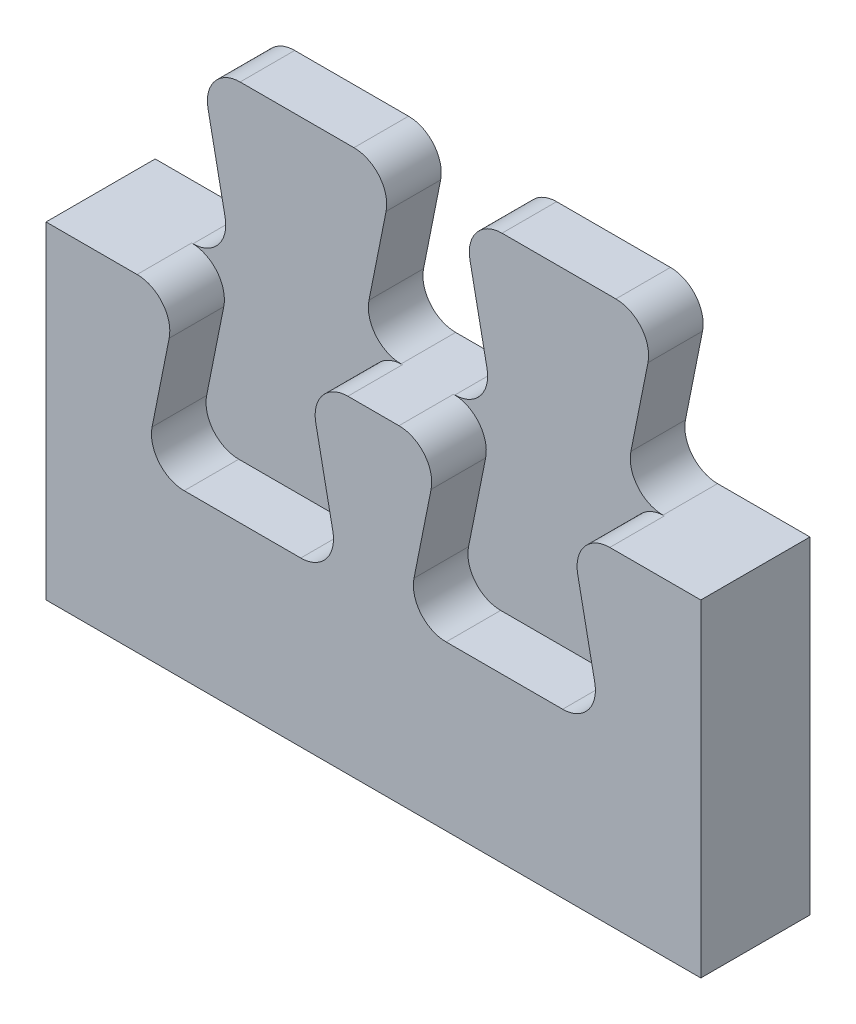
ISO-10303-21;
HEADER;
FILE_DESCRIPTION(('STEP AP214'),'2;1');
FILE_NAME('part.step','',(''),(''),'','','');
FILE_SCHEMA(('AUTOMOTIVE_DESIGN { 1 0 10303 214 1 1 1 1 }'));
ENDSEC;
DATA;
#1=APPLICATION_CONTEXT('core data for automotive mechanical design processes');
#2=APPLICATION_PROTOCOL_DEFINITION('international standard','automotive_design',2000,#1);
#3=PRODUCT_CONTEXT('',#1,'mechanical');
#4=PRODUCT('Part','Part','',(#3));
#5=PRODUCT_RELATED_PRODUCT_CATEGORY('part','',(#4));
#6=PRODUCT_DEFINITION_FORMATION('','',#4);
#7=PRODUCT_DEFINITION_CONTEXT('part definition',#1,'design');
#8=PRODUCT_DEFINITION('design','',#6,#7);
#9=PRODUCT_DEFINITION_SHAPE('','',#8);
#10=(LENGTH_UNIT() NAMED_UNIT(*) SI_UNIT(.MILLI.,.METRE.));
#11=(NAMED_UNIT(*) PLANE_ANGLE_UNIT() SI_UNIT($,.RADIAN.));
#12=(NAMED_UNIT(*) SI_UNIT($,.STERADIAN.) SOLID_ANGLE_UNIT());
#13=UNCERTAINTY_MEASURE_WITH_UNIT(LENGTH_MEASURE(1.E-05),#10,'distance_accuracy_value','');
#14=(GEOMETRIC_REPRESENTATION_CONTEXT(3) GLOBAL_UNCERTAINTY_ASSIGNED_CONTEXT((#13)) GLOBAL_UNIT_ASSIGNED_CONTEXT((#10,
#11,#12)) REPRESENTATION_CONTEXT('',''));
#15=CARTESIAN_POINT('',(0.,0.,0.));
#16=DIRECTION('',(0.,0.,1.));
#17=DIRECTION('',(1.,0.,0.));
#18=AXIS2_PLACEMENT_3D('',#15,#16,#17);
#19=CARTESIAN_POINT('',(-11.7339215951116,36.6112155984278,10.));
#20=DIRECTION('',(-0.98058067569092,-0.196116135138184,0.));
#21=DIRECTION('',(0.196116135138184,-0.98058067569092,0.));
#22=AXIS2_PLACEMENT_3D('',#19,#20,#21);
#23=PLANE('',#22);
#24=DIRECTION('',(-0.196116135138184,0.98058067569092,0.));
#25=VECTOR('',#24,1.);
#26=CARTESIAN_POINT('',(-11.7339215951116,36.6112155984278,0.));
#27=LINE('',#26,#25);
#28=CARTESIAN_POINT('',(-12.4515912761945,40.1995640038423,0.));
#29=VERTEX_POINT('',#28);
#30=CARTESIAN_POINT('',(-14.0162519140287,48.0228671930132,0.));
#31=VERTEX_POINT('',#30);
#32=EDGE_CURVE('E643',#29,#31,#27,.T.);
#33=ORIENTED_EDGE('',*,*,#32,.F.);
#34=DIRECTION('',(0.,0.,-1.));
#35=VECTOR('',#34,1.);
#36=CARTESIAN_POINT('',(-12.4515912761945,40.1995640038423,5.));
#37=LINE('',#36,#35);
#38=CARTESIAN_POINT('',(-12.4515912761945,40.1995640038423,5.));
#39=VERTEX_POINT('',#38);
#40=EDGE_CURVE('E63',#29,#39,#37,.F.);
#41=ORIENTED_EDGE('',*,*,#40,.T.);
#42=DIRECTION('',(0.196116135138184,-0.98058067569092,0.));
#43=VECTOR('',#42,1.);
#44=CARTESIAN_POINT('',(-11.7339215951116,36.6112155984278,5.));
#45=LINE('',#44,#43);
#46=CARTESIAN_POINT('',(-14.0162519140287,48.0228671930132,5.));
#47=VERTEX_POINT('',#46);
#48=EDGE_CURVE('E668',#47,#39,#45,.T.);
#49=ORIENTED_EDGE('',*,*,#48,.F.);
#50=DIRECTION('',(0.,0.,-1.));
#51=VECTOR('',#50,1.);
#52=CARTESIAN_POINT('',(-14.0162519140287,48.0228671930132,10.));
#53=LINE('',#52,#51);
#54=EDGE_CURVE('E457',#47,#31,#53,.T.);
#55=ORIENTED_EDGE('',*,*,#54,.T.);
#56=EDGE_LOOP('',(#33,#41,#49,#55));
#57=FACE_BOUND('',#56,.T.);
#58=ADVANCED_FACE('F41',(#57),#23,.T.);
#59=CARTESIAN_POINT('',(-23.8589215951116,36.6112155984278,10.));
#60=DIRECTION('',(0.,1.,0.));
#61=DIRECTION('',(0.,0.,1.));
#62=AXIS2_PLACEMENT_3D('',#59,#60,#61);
#63=PLANE('',#62);
#64=DIRECTION('',(-1.,0.,0.));
#65=VECTOR('',#64,1.);
#66=CARTESIAN_POINT('',(-23.8589215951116,36.6112155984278,5.));
#67=LINE('',#66,#65);
#68=CARTESIAN_POINT('',(-15.3933333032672,36.6112155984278,5.));
#69=VERTEX_POINT('',#68);
#70=CARTESIAN_POINT('',(-15.5183333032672,36.6112155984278,5.));
#71=VERTEX_POINT('',#70);
#72=EDGE_CURVE('E670',#69,#71,#67,.T.);
#73=ORIENTED_EDGE('',*,*,#72,.F.);
#74=DIRECTION('',(0.,0.,-1.));
#75=VECTOR('',#74,1.);
#76=CARTESIAN_POINT('',(-15.3933333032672,36.6112155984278,0.));
#77=LINE('',#76,#75);
#78=CARTESIAN_POINT('',(-15.3933333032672,36.6112155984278,0.));
#79=VERTEX_POINT('',#78);
#80=EDGE_CURVE('E531',#69,#79,#77,.T.);
#81=ORIENTED_EDGE('',*,*,#80,.T.);
#82=DIRECTION('',(1.,0.,0.));
#83=VECTOR('',#82,1.);
#84=CARTESIAN_POINT('',(-23.8589215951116,36.6112155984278,0.));
#85=LINE('',#84,#83);
#86=CARTESIAN_POINT('',(-23.8589215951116,36.6112155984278,0.));
#87=VERTEX_POINT('',#86);
#88=EDGE_CURVE('E609',#87,#79,#85,.T.);
#89=ORIENTED_EDGE('',*,*,#88,.F.);
#90=DIRECTION('',(0.,0.,-1.));
#91=VECTOR('',#90,1.);
#92=CARTESIAN_POINT('',(-23.8589215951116,36.6112155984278,10.));
#93=LINE('',#92,#91);
#94=CARTESIAN_POINT('',(-23.8589215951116,36.6112155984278,10.));
#95=VERTEX_POINT('',#94);
#96=EDGE_CURVE('E368',#95,#87,#93,.T.);
#97=ORIENTED_EDGE('',*,*,#96,.F.);
#98=DIRECTION('',(1.,0.,0.));
#99=VECTOR('',#98,1.);
#100=CARTESIAN_POINT('',(-23.8589215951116,36.6112155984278,10.));
#101=LINE('',#100,#99);
#102=CARTESIAN_POINT('',(-15.5183333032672,36.6112155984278,10.));
#103=VERTEX_POINT('',#102);
#104=EDGE_CURVE('E352',#95,#103,#101,.T.);
#105=ORIENTED_EDGE('',*,*,#104,.T.);
#106=DIRECTION('',(0.,0.,1.));
#107=VECTOR('',#106,1.);
#108=CARTESIAN_POINT('',(-15.5183333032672,36.6112155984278,5.));
#109=LINE('',#108,#107);
#110=EDGE_CURVE('E481',#103,#71,#109,.F.);
#111=ORIENTED_EDGE('',*,*,#110,.T.);
#112=EDGE_LOOP('',(#73,#81,#89,#97,#105,#111));
#113=FACE_BOUND('',#112,.T.);
#114=ADVANCED_FACE('F773',(#113),#63,.T.);
#115=CARTESIAN_POINT('',(-23.8589215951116,36.6112155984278,10.));
#116=DIRECTION('',(1.,0.,0.));
#117=DIRECTION('',(0.,1.,0.));
#118=AXIS2_PLACEMENT_3D('',#115,#116,#117);
#119=PLANE('',#118);
#120=DIRECTION('',(0.,-1.,0.));
#121=VECTOR('',#120,1.);
#122=CARTESIAN_POINT('',(-23.8589215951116,36.6112155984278,0.));
#123=LINE('',#122,#121);
#124=CARTESIAN_POINT('',(-23.8589215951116,6.61121559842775,0.));
#125=VERTEX_POINT('',#124);
#126=EDGE_CURVE('E606',#87,#125,#123,.T.);
#127=ORIENTED_EDGE('',*,*,#126,.T.);
#128=DIRECTION('',(0.,0.,-1.));
#129=VECTOR('',#128,1.);
#130=CARTESIAN_POINT('',(-23.8589215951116,6.61121559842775,10.));
#131=LINE('',#130,#129);
#132=CARTESIAN_POINT('',(-23.8589215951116,6.61121559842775,10.));
#133=VERTEX_POINT('',#132);
#134=EDGE_CURVE('E357',#133,#125,#131,.T.);
#135=ORIENTED_EDGE('',*,*,#134,.F.);
#136=DIRECTION('',(0.,-1.,0.));
#137=VECTOR('',#136,1.);
#138=CARTESIAN_POINT('',(-23.8589215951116,36.6112155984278,10.));
#139=LINE('',#138,#137);
#140=EDGE_CURVE('E360',#95,#133,#139,.T.);
#141=ORIENTED_EDGE('',*,*,#140,.F.);
#142=ORIENTED_EDGE('',*,*,#96,.T.);
#143=EDGE_LOOP('',(#127,#135,#141,#142));
#144=FACE_BOUND('',#143,.T.);
#145=ADVANCED_FACE('F778',(#144),#119,.F.);
#146=CARTESIAN_POINT('',(-23.8589215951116,6.61121559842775,10.));
#147=DIRECTION('',(0.,1.,0.));
#148=DIRECTION('',(0.,0.,1.));
#149=AXIS2_PLACEMENT_3D('',#146,#147,#148);
#150=PLANE('',#149);
#151=DIRECTION('',(1.,0.,0.));
#152=VECTOR('',#151,1.);
#153=CARTESIAN_POINT('',(-23.8589215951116,6.61121559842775,0.));
#154=LINE('',#153,#152);
#155=CARTESIAN_POINT('',(36.1410784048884,6.61121559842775,0.));
#156=VERTEX_POINT('',#155);
#157=EDGE_CURVE('E603',#125,#156,#154,.T.);
#158=ORIENTED_EDGE('',*,*,#157,.T.);
#159=DIRECTION('',(0.,0.,-1.));
#160=VECTOR('',#159,1.);
#161=CARTESIAN_POINT('',(36.1410784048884,6.61121559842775,10.));
#162=LINE('',#161,#160);
#163=CARTESIAN_POINT('',(36.1410784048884,6.61121559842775,10.));
#164=VERTEX_POINT('',#163);
#165=EDGE_CURVE('E351',#164,#156,#162,.T.);
#166=ORIENTED_EDGE('',*,*,#165,.F.);
#167=DIRECTION('',(1.,0.,0.));
#168=VECTOR('',#167,1.);
#169=CARTESIAN_POINT('',(-23.8589215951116,6.61121559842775,10.));
#170=LINE('',#169,#168);
#171=EDGE_CURVE('E341',#133,#164,#170,.T.);
#172=ORIENTED_EDGE('',*,*,#171,.F.);
#173=ORIENTED_EDGE('',*,*,#134,.T.);
#174=EDGE_LOOP('',(#158,#166,#172,#173));
#175=FACE_BOUND('',#174,.T.);
#176=ADVANCED_FACE('F616',(#175),#150,.F.);
#177=CARTESIAN_POINT('',(36.1410784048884,6.61121559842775,10.));
#178=DIRECTION('',(-1.,0.,0.));
#179=DIRECTION('',(0.,0.,1.));
#180=AXIS2_PLACEMENT_3D('',#177,#178,#179);
#181=PLANE('',#180);
#182=DIRECTION('',(0.,1.,0.));
#183=VECTOR('',#182,1.);
#184=CARTESIAN_POINT('',(36.1410784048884,6.61121559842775,0.));
#185=LINE('',#184,#183);
#186=CARTESIAN_POINT('',(36.1410784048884,36.6112155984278,0.));
#187=VERTEX_POINT('',#186);
#188=EDGE_CURVE('E349',#156,#187,#185,.T.);
#189=ORIENTED_EDGE('',*,*,#188,.T.);
#190=DIRECTION('',(0.,0.,-1.));
#191=VECTOR('',#190,1.);
#192=CARTESIAN_POINT('',(36.1410784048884,36.6112155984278,10.));
#193=LINE('',#192,#191);
#194=CARTESIAN_POINT('',(36.1410784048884,36.6112155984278,10.));
#195=VERTEX_POINT('',#194);
#196=EDGE_CURVE('E328',#195,#187,#193,.T.);
#197=ORIENTED_EDGE('',*,*,#196,.F.);
#198=DIRECTION('',(0.,1.,0.));
#199=VECTOR('',#198,1.);
#200=CARTESIAN_POINT('',(36.1410784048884,6.61121559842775,10.));
#201=LINE('',#200,#199);
#202=EDGE_CURVE('E334',#164,#195,#201,.T.);
#203=ORIENTED_EDGE('',*,*,#202,.F.);
#204=ORIENTED_EDGE('',*,*,#165,.T.);
#205=EDGE_LOOP('',(#189,#197,#203,#204));
#206=FACE_BOUND('',#205,.T.);
#207=ADVANCED_FACE('F347',(#206),#181,.F.);
#208=CARTESIAN_POINT('',(24.0160784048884,36.6112155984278,10.));
#209=DIRECTION('',(0.,1.,0.));
#210=DIRECTION('',(-1.,0.,0.));
#211=AXIS2_PLACEMENT_3D('',#208,#209,#210);
#212=PLANE('',#211);
#213=DIRECTION('',(1.,0.,0.));
#214=VECTOR('',#213,1.);
#215=CARTESIAN_POINT('',(24.0160784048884,36.6112155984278,0.));
#216=LINE('',#215,#214);
#217=CARTESIAN_POINT('',(27.6754901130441,36.6112155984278,0.));
#218=VERTEX_POINT('',#217);
#219=EDGE_CURVE('E599',#218,#187,#216,.T.);
#220=ORIENTED_EDGE('',*,*,#219,.F.);
#221=DIRECTION('',(0.,0.,-1.));
#222=VECTOR('',#221,1.);
#223=CARTESIAN_POINT('',(27.6754901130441,36.6112155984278,5.));
#224=LINE('',#223,#222);
#225=CARTESIAN_POINT('',(27.6754901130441,36.6112155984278,5.));
#226=VERTEX_POINT('',#225);
#227=EDGE_CURVE('E514',#218,#226,#224,.F.);
#228=ORIENTED_EDGE('',*,*,#227,.T.);
#229=DIRECTION('',(-1.,0.,0.));
#230=VECTOR('',#229,1.);
#231=CARTESIAN_POINT('',(24.0160784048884,36.6112155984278,5.));
#232=LINE('',#231,#230);
#233=CARTESIAN_POINT('',(27.8004901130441,36.6112155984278,5.));
#234=VERTEX_POINT('',#233);
#235=EDGE_CURVE('E632',#234,#226,#232,.T.);
#236=ORIENTED_EDGE('',*,*,#235,.F.);
#237=DIRECTION('',(0.,0.,1.));
#238=VECTOR('',#237,1.);
#239=CARTESIAN_POINT('',(27.8004901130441,36.6112155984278,10.));
#240=LINE('',#239,#238);
#241=CARTESIAN_POINT('',(27.8004901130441,36.6112155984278,10.));
#242=VERTEX_POINT('',#241);
#243=EDGE_CURVE('E331',#234,#242,#240,.T.);
#244=ORIENTED_EDGE('',*,*,#243,.T.);
#245=DIRECTION('',(1.,0.,0.));
#246=VECTOR('',#245,1.);
#247=CARTESIAN_POINT('',(24.0160784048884,36.6112155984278,10.));
#248=LINE('',#247,#246);
#249=EDGE_CURVE('E323',#242,#195,#248,.T.);
#250=ORIENTED_EDGE('',*,*,#249,.T.);
#251=ORIENTED_EDGE('',*,*,#196,.T.);
#252=EDGE_LOOP('',(#220,#228,#236,#244,#250,#251));
#253=FACE_BOUND('',#252,.T.);
#254=ADVANCED_FACE('F326',(#253),#212,.T.);
#255=CARTESIAN_POINT('',(27.0160784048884,51.6112155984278,10.));
#256=DIRECTION('',(0.98058067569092,-0.196116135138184,0.));
#257=DIRECTION('',(0.196116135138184,0.98058067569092,0.));
#258=AXIS2_PLACEMENT_3D('',#255,#256,#257);
#259=PLANE('',#258);
#260=DIRECTION('',(0.196116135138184,0.98058067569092,0.));
#261=VECTOR('',#260,1.);
#262=CARTESIAN_POINT('',(27.0160784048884,51.6112155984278,5.));
#263=LINE('',#262,#261);
#264=CARTESIAN_POINT('',(24.7337480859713,40.1995640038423,5.));
#265=VERTEX_POINT('',#264);
#266=CARTESIAN_POINT('',(26.2984087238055,48.0228671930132,5.));
#267=VERTEX_POINT('',#266);
#268=EDGE_CURVE('E631',#265,#267,#263,.T.);
#269=ORIENTED_EDGE('',*,*,#268,.F.);
#270=DIRECTION('',(0.,0.,-1.));
#271=VECTOR('',#270,1.);
#272=CARTESIAN_POINT('',(24.7337480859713,40.1995640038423,0.));
#273=LINE('',#272,#271);
#274=CARTESIAN_POINT('',(24.7337480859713,40.1995640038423,0.));
#275=VERTEX_POINT('',#274);
#276=EDGE_CURVE('E510',#265,#275,#273,.T.);
#277=ORIENTED_EDGE('',*,*,#276,.T.);
#278=DIRECTION('',(-0.196116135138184,-0.98058067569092,0.));
#279=VECTOR('',#278,1.);
#280=CARTESIAN_POINT('',(27.0160784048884,51.6112155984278,0.));
#281=LINE('',#280,#279);
#282=CARTESIAN_POINT('',(26.2984087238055,48.0228671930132,0.));
#283=VERTEX_POINT('',#282);
#284=EDGE_CURVE('E595',#283,#275,#281,.T.);
#285=ORIENTED_EDGE('',*,*,#284,.F.);
#286=DIRECTION('',(0.,0.,-1.));
#287=VECTOR('',#286,1.);
#288=CARTESIAN_POINT('',(26.2984087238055,48.0228671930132,10.));
#289=LINE('',#288,#287);
#290=EDGE_CURVE('E434',#283,#267,#289,.F.);
#291=ORIENTED_EDGE('',*,*,#290,.T.);
#292=EDGE_LOOP('',(#269,#277,#285,#291));
#293=FACE_BOUND('',#292,.T.);
#294=ADVANCED_FACE('F634',(#293),#259,.T.);
#295=CARTESIAN_POINT('',(9.26607840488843,51.6112155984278,10.));
#296=DIRECTION('',(0.,1.,0.));
#297=DIRECTION('',(0.,0.,1.));
#298=AXIS2_PLACEMENT_3D('',#295,#296,#297);
#299=PLANE('',#298);
#300=DIRECTION('',(-1.,0.,0.));
#301=VECTOR('',#300,1.);
#302=CARTESIAN_POINT('',(9.26607840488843,51.6112155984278,5.));
#303=LINE('',#302,#301);
#304=CARTESIAN_POINT('',(23.3566666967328,51.6112155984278,5.));
#305=VERTEX_POINT('',#304);
#306=CARTESIAN_POINT('',(12.9254901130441,51.6112155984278,5.));
#307=VERTEX_POINT('',#306);
#308=EDGE_CURVE('E639',#305,#307,#303,.T.);
#309=ORIENTED_EDGE('',*,*,#308,.F.);
#310=DIRECTION('',(0.,0.,-1.));
#311=VECTOR('',#310,1.);
#312=CARTESIAN_POINT('',(23.3566666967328,51.6112155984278,10.));
#313=LINE('',#312,#311);
#314=CARTESIAN_POINT('',(23.3566666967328,51.6112155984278,0.));
#315=VERTEX_POINT('',#314);
#316=EDGE_CURVE('E423',#305,#315,#313,.T.);
#317=ORIENTED_EDGE('',*,*,#316,.T.);
#318=DIRECTION('',(1.,0.,0.));
#319=VECTOR('',#318,1.);
#320=CARTESIAN_POINT('',(9.26607840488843,51.6112155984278,0.));
#321=LINE('',#320,#319);
#322=CARTESIAN_POINT('',(12.9254901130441,51.6112155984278,0.));
#323=VERTEX_POINT('',#322);
#324=EDGE_CURVE('E587',#323,#315,#321,.T.);
#325=ORIENTED_EDGE('',*,*,#324,.F.);
#326=DIRECTION('',(0.,0.,-1.));
#327=VECTOR('',#326,1.);
#328=CARTESIAN_POINT('',(12.9254901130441,51.6112155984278,10.));
#329=LINE('',#328,#327);
#330=EDGE_CURVE('E421',#323,#307,#329,.F.);
#331=ORIENTED_EDGE('',*,*,#330,.T.);
#332=EDGE_LOOP('',(#309,#317,#325,#331));
#333=FACE_BOUND('',#332,.T.);
#334=ADVANCED_FACE('F839',(#333),#299,.T.);
#335=CARTESIAN_POINT('',(12.2660784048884,36.6112155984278,10.));
#336=DIRECTION('',(-0.98058067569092,-0.196116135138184,0.));
#337=DIRECTION('',(0.196116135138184,-0.98058067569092,0.));
#338=AXIS2_PLACEMENT_3D('',#335,#336,#337);
#339=PLANE('',#338);
#340=DIRECTION('',(-0.196116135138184,0.98058067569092,0.));
#341=VECTOR('',#340,1.);
#342=CARTESIAN_POINT('',(12.2660784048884,36.6112155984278,0.));
#343=LINE('',#342,#341);
#344=CARTESIAN_POINT('',(11.5484087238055,40.1995640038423,0.));
#345=VERTEX_POINT('',#344);
#346=CARTESIAN_POINT('',(9.98374808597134,48.0228671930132,0.));
#347=VERTEX_POINT('',#346);
#348=EDGE_CURVE('E583',#345,#347,#343,.T.);
#349=ORIENTED_EDGE('',*,*,#348,.F.);
#350=DIRECTION('',(0.,0.,-1.));
#351=VECTOR('',#350,1.);
#352=CARTESIAN_POINT('',(11.5484087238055,40.1995640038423,5.));
#353=LINE('',#352,#351);
#354=CARTESIAN_POINT('',(11.5484087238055,40.1995640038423,5.));
#355=VERTEX_POINT('',#354);
#356=EDGE_CURVE('E524',#345,#355,#353,.F.);
#357=ORIENTED_EDGE('',*,*,#356,.T.);
#358=DIRECTION('',(0.196116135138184,-0.98058067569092,0.));
#359=VECTOR('',#358,1.);
#360=CARTESIAN_POINT('',(12.2660784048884,36.6112155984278,5.));
#361=LINE('',#360,#359);
#362=CARTESIAN_POINT('',(9.98374808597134,48.0228671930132,5.));
#363=VERTEX_POINT('',#362);
#364=EDGE_CURVE('E646',#363,#355,#361,.T.);
#365=ORIENTED_EDGE('',*,*,#364,.F.);
#366=DIRECTION('',(0.,0.,-1.));
#367=VECTOR('',#366,1.);
#368=CARTESIAN_POINT('',(9.98374808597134,48.0228671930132,10.));
#369=LINE('',#368,#367);
#370=EDGE_CURVE('E437',#363,#347,#369,.T.);
#371=ORIENTED_EDGE('',*,*,#370,.T.);
#372=EDGE_LOOP('',(#349,#357,#365,#371));
#373=FACE_BOUND('',#372,.T.);
#374=ADVANCED_FACE('F842',(#373),#339,.T.);
#375=CARTESIAN_POINT('',(0.0160784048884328,36.6112155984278,10.));
#376=DIRECTION('',(0.,1.,0.));
#377=DIRECTION('',(0.,0.,1.));
#378=AXIS2_PLACEMENT_3D('',#375,#376,#377);
#379=PLANE('',#378);
#380=DIRECTION('',(-1.,0.,0.));
#381=VECTOR('',#380,1.);
#382=CARTESIAN_POINT('',(0.0160784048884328,36.6112155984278,5.));
#383=LINE('',#382,#381);
#384=CARTESIAN_POINT('',(8.60666669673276,36.6112155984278,5.));
#385=VERTEX_POINT('',#384);
#386=CARTESIAN_POINT('',(8.48166669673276,36.6112155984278,5.));
#387=VERTEX_POINT('',#386);
#388=EDGE_CURVE('E672',#385,#387,#383,.T.);
#389=ORIENTED_EDGE('',*,*,#388,.F.);
#390=DIRECTION('',(0.,0.,-1.));
#391=VECTOR('',#390,1.);
#392=CARTESIAN_POINT('',(8.60666669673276,36.6112155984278,0.));
#393=LINE('',#392,#391);
#394=CARTESIAN_POINT('',(8.60666669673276,36.6112155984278,0.));
#395=VERTEX_POINT('',#394);
#396=EDGE_CURVE('E520',#385,#395,#393,.T.);
#397=ORIENTED_EDGE('',*,*,#396,.T.);
#398=DIRECTION('',(1.,0.,0.));
#399=VECTOR('',#398,1.);
#400=CARTESIAN_POINT('',(0.0160784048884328,36.6112155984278,0.));
#401=LINE('',#400,#399);
#402=CARTESIAN_POINT('',(3.6754901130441,36.6112155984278,0.));
#403=VERTEX_POINT('',#402);
#404=EDGE_CURVE('E576',#403,#395,#401,.T.);
#405=ORIENTED_EDGE('',*,*,#404,.F.);
#406=DIRECTION('',(0.,0.,-1.));
#407=VECTOR('',#406,1.);
#408=CARTESIAN_POINT('',(3.6754901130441,36.6112155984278,5.));
#409=LINE('',#408,#407);
#410=CARTESIAN_POINT('',(3.6754901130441,36.6112155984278,5.));
#411=VERTEX_POINT('',#410);
#412=EDGE_CURVE('E517',#403,#411,#409,.F.);
#413=ORIENTED_EDGE('',*,*,#412,.T.);
#414=CARTESIAN_POINT('',(3.8004901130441,36.6112155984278,5.));
#415=VERTEX_POINT('',#414);
#416=EDGE_CURVE('E558',#415,#411,#383,.T.);
#417=ORIENTED_EDGE('',*,*,#416,.F.);
#418=DIRECTION('',(0.,0.,1.));
#419=VECTOR('',#418,1.);
#420=CARTESIAN_POINT('',(3.8004901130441,36.6112155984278,10.));
#421=LINE('',#420,#419);
#422=CARTESIAN_POINT('',(3.8004901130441,36.6112155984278,10.));
#423=VERTEX_POINT('',#422);
#424=EDGE_CURVE('E411',#415,#423,#421,.T.);
#425=ORIENTED_EDGE('',*,*,#424,.T.);
#426=DIRECTION('',(1.,0.,0.));
#427=VECTOR('',#426,1.);
#428=CARTESIAN_POINT('',(0.0160784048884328,36.6112155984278,10.));
#429=LINE('',#428,#427);
#430=CARTESIAN_POINT('',(8.48166669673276,36.6112155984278,10.));
#431=VERTEX_POINT('',#430);
#432=EDGE_CURVE('E335',#423,#431,#429,.T.);
#433=ORIENTED_EDGE('',*,*,#432,.T.);
#434=DIRECTION('',(0.,0.,1.));
#435=VECTOR('',#434,1.);
#436=CARTESIAN_POINT('',(8.48166669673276,36.6112155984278,5.));
#437=LINE('',#436,#435);
#438=EDGE_CURVE('E415',#431,#387,#437,.F.);
#439=ORIENTED_EDGE('',*,*,#438,.T.);
#440=EDGE_LOOP('',(#389,#397,#405,#413,#417,#425,#433,#439));
#441=FACE_BOUND('',#440,.T.);
#442=ADVANCED_FACE('F580',(#441),#379,.T.);
#443=CARTESIAN_POINT('',(3.01607840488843,51.6112155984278,10.));
#444=DIRECTION('',(0.98058067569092,-0.196116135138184,0.));
#445=DIRECTION('',(0.196116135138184,0.98058067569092,0.));
#446=AXIS2_PLACEMENT_3D('',#443,#444,#445);
#447=PLANE('',#446);
#448=DIRECTION('',(0.196116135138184,0.98058067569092,0.));
#449=VECTOR('',#448,1.);
#450=CARTESIAN_POINT('',(3.01607840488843,51.6112155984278,5.));
#451=LINE('',#450,#449);
#452=CARTESIAN_POINT('',(0.733748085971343,40.1995640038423,5.));
#453=VERTEX_POINT('',#452);
#454=CARTESIAN_POINT('',(2.29840872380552,48.0228671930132,5.));
#455=VERTEX_POINT('',#454);
#456=EDGE_CURVE('E557',#453,#455,#451,.T.);
#457=ORIENTED_EDGE('',*,*,#456,.F.);
#458=DIRECTION('',(0.,0.,-1.));
#459=VECTOR('',#458,1.);
#460=CARTESIAN_POINT('',(0.733748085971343,40.1995640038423,0.));
#461=LINE('',#460,#459);
#462=CARTESIAN_POINT('',(0.733748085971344,40.1995640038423,0.));
#463=VERTEX_POINT('',#462);
#464=EDGE_CURVE('E527',#453,#463,#461,.T.);
#465=ORIENTED_EDGE('',*,*,#464,.T.);
#466=DIRECTION('',(-0.196116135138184,-0.98058067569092,0.));
#467=VECTOR('',#466,1.);
#468=CARTESIAN_POINT('',(3.01607840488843,51.6112155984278,0.));
#469=LINE('',#468,#467);
#470=CARTESIAN_POINT('',(2.29840872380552,48.0228671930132,0.));
#471=VERTEX_POINT('',#470);
#472=EDGE_CURVE('E577',#471,#463,#469,.T.);
#473=ORIENTED_EDGE('',*,*,#472,.F.);
#474=DIRECTION('',(0.,0.,-1.));
#475=VECTOR('',#474,1.);
#476=CARTESIAN_POINT('',(2.29840872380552,48.0228671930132,10.));
#477=LINE('',#476,#475);
#478=EDGE_CURVE('E445',#471,#455,#477,.F.);
#479=ORIENTED_EDGE('',*,*,#478,.T.);
#480=EDGE_LOOP('',(#457,#465,#473,#479));
#481=FACE_BOUND('',#480,.T.);
#482=ADVANCED_FACE('F563',(#481),#447,.T.);
#483=CARTESIAN_POINT('',(-14.7339215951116,51.6112155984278,10.));
#484=DIRECTION('',(0.,1.,0.));
#485=DIRECTION('',(-1.,0.,0.));
#486=AXIS2_PLACEMENT_3D('',#483,#484,#485);
#487=PLANE('',#486);
#488=DIRECTION('',(-1.,0.,0.));
#489=VECTOR('',#488,1.);
#490=CARTESIAN_POINT('',(-14.7339215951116,51.6112155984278,5.));
#491=LINE('',#490,#489);
#492=CARTESIAN_POINT('',(-0.643333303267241,51.6112155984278,5.));
#493=VERTEX_POINT('',#492);
#494=CARTESIAN_POINT('',(-11.0745098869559,51.6112155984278,5.));
#495=VERTEX_POINT('',#494);
#496=EDGE_CURVE('E364',#493,#495,#491,.T.);
#497=ORIENTED_EDGE('',*,*,#496,.F.);
#498=DIRECTION('',(0.,0.,-1.));
#499=VECTOR('',#498,1.);
#500=CARTESIAN_POINT('',(-0.643333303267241,51.6112155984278,10.));
#501=LINE('',#500,#499);
#502=CARTESIAN_POINT('',(-0.643333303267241,51.6112155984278,0.));
#503=VERTEX_POINT('',#502);
#504=EDGE_CURVE('E442',#493,#503,#501,.T.);
#505=ORIENTED_EDGE('',*,*,#504,.T.);
#506=DIRECTION('',(1.,0.,0.));
#507=VECTOR('',#506,1.);
#508=CARTESIAN_POINT('',(-14.7339215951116,51.6112155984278,0.));
#509=LINE('',#508,#507);
#510=CARTESIAN_POINT('',(-11.0745098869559,51.6112155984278,0.));
#511=VERTEX_POINT('',#510);
#512=EDGE_CURVE('E590',#511,#503,#509,.T.);
#513=ORIENTED_EDGE('',*,*,#512,.F.);
#514=DIRECTION('',(0.,0.,-1.));
#515=VECTOR('',#514,1.);
#516=CARTESIAN_POINT('',(-11.0745098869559,51.6112155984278,10.));
#517=LINE('',#516,#515);
#518=EDGE_CURVE('E440',#511,#495,#517,.F.);
#519=ORIENTED_EDGE('',*,*,#518,.T.);
#520=EDGE_LOOP('',(#497,#505,#513,#519));
#521=FACE_BOUND('',#520,.T.);
#522=ADVANCED_FACE('F662',(#521),#487,.T.);
#523=CARTESIAN_POINT('',(0.,0.,10.));
#524=DIRECTION('',(0.,0.,-1.));
#525=DIRECTION('',(-1.,0.,0.));
#526=AXIS2_PLACEMENT_3D('',#523,#524,#525);
#527=PLANE('',#526);
#528=DIRECTION('',(-0.196116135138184,-0.98058067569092,0.));
#529=VECTOR('',#528,1.);
#530=CARTESIAN_POINT('',(12.1410784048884,36.6112155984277,10.));
#531=LINE('',#530,#529);
#532=CARTESIAN_POINT('',(11.4234087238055,33.0228671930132,10.));
#533=VERTEX_POINT('',#532);
#534=CARTESIAN_POINT('',(9.85874808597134,25.1995640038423,10.));
#535=VERTEX_POINT('',#534);
#536=EDGE_CURVE('E691',#533,#535,#531,.T.);
#537=ORIENTED_EDGE('',*,*,#536,.F.);
#538=CARTESIAN_POINT('',(8.48166669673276,33.6112155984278,10.));
#539=DIRECTION('',(0.,0.,-1.));
#540=DIRECTION('',(-1.,0.,0.));
#541=AXIS2_PLACEMENT_3D('',#538,#539,#540);
#542=CIRCLE('',#541,3.);
#543=EDGE_CURVE('E408',#533,#431,#542,.F.);
#544=ORIENTED_EDGE('',*,*,#543,.T.);
#545=ORIENTED_EDGE('',*,*,#432,.F.);
#546=CARTESIAN_POINT('',(3.8004901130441,33.6112155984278,10.));
#547=DIRECTION('',(0.,0.,-1.));
#548=DIRECTION('',(-1.,0.,0.));
#549=AXIS2_PLACEMENT_3D('',#546,#547,#548);
#550=CIRCLE('',#549,3.);
#551=CARTESIAN_POINT('',(0.858748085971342,33.0228671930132,10.));
#552=VERTEX_POINT('',#551);
#553=EDGE_CURVE('E402',#423,#552,#550,.F.);
#554=ORIENTED_EDGE('',*,*,#553,.T.);
#555=DIRECTION('',(-0.196116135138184,0.98058067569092,0.));
#556=VECTOR('',#555,1.);
#557=CARTESIAN_POINT('',(3.14107840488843,21.6112155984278,10.));
#558=LINE('',#557,#556);
#559=CARTESIAN_POINT('',(2.42340872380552,25.1995640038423,10.));
#560=VERTEX_POINT('',#559);
#561=EDGE_CURVE('E697',#560,#552,#558,.T.);
#562=ORIENTED_EDGE('',*,*,#561,.F.);
#563=CARTESIAN_POINT('',(-0.518333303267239,24.6112155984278,10.));
#564=DIRECTION('',(0.,0.,-1.));
#565=DIRECTION('',(-1.,0.,0.));
#566=AXIS2_PLACEMENT_3D('',#563,#564,#565);
#567=CIRCLE('',#566,3.);
#568=CARTESIAN_POINT('',(-0.518333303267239,21.6112155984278,10.));
#569=VERTEX_POINT('',#568);
#570=EDGE_CURVE('E500',#560,#569,#567,.T.);
#571=ORIENTED_EDGE('',*,*,#570,.T.);
#572=DIRECTION('',(1.,0.,0.));
#573=VECTOR('',#572,1.);
#574=CARTESIAN_POINT('',(-14.8589215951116,21.6112155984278,10.));
#575=LINE('',#574,#573);
#576=CARTESIAN_POINT('',(-11.1995098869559,21.6112155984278,10.));
#577=VERTEX_POINT('',#576);
#578=EDGE_CURVE('E706',#577,#569,#575,.T.);
#579=ORIENTED_EDGE('',*,*,#578,.F.);
#580=CARTESIAN_POINT('',(-11.1995098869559,24.6112155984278,10.));
#581=DIRECTION('',(0.,0.,-1.));
#582=DIRECTION('',(-1.,0.,0.));
#583=AXIS2_PLACEMENT_3D('',#580,#581,#582);
#584=CIRCLE('',#583,3.);
#585=CARTESIAN_POINT('',(-14.1412519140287,25.1995640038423,10.));
#586=VERTEX_POINT('',#585);
#587=EDGE_CURVE('E497',#577,#586,#584,.T.);
#588=ORIENTED_EDGE('',*,*,#587,.T.);
#589=DIRECTION('',(-0.196116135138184,-0.98058067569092,0.));
#590=VECTOR('',#589,1.);
#591=CARTESIAN_POINT('',(-11.8589215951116,36.6112155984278,10.));
#592=LINE('',#591,#590);
#593=CARTESIAN_POINT('',(-12.5765912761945,33.0228671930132,10.));
#594=VERTEX_POINT('',#593);
#595=EDGE_CURVE('E737',#594,#586,#592,.T.);
#596=ORIENTED_EDGE('',*,*,#595,.F.);
#597=CARTESIAN_POINT('',(-15.5183333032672,33.6112155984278,10.));
#598=DIRECTION('',(0.,0.,-1.));
#599=DIRECTION('',(-1.,0.,0.));
#600=AXIS2_PLACEMENT_3D('',#597,#598,#599);
#601=CIRCLE('',#600,3.);
#602=EDGE_CURVE('E399',#594,#103,#601,.F.);
#603=ORIENTED_EDGE('',*,*,#602,.T.);
#604=ORIENTED_EDGE('',*,*,#104,.F.);
#605=ORIENTED_EDGE('',*,*,#140,.T.);
#606=ORIENTED_EDGE('',*,*,#171,.T.);
#607=ORIENTED_EDGE('',*,*,#202,.T.);
#608=ORIENTED_EDGE('',*,*,#249,.F.);
#609=CARTESIAN_POINT('',(27.8004901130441,33.6112155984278,10.));
#610=DIRECTION('',(0.,0.,-1.));
#611=DIRECTION('',(-1.,0.,0.));
#612=AXIS2_PLACEMENT_3D('',#609,#610,#611);
#613=CIRCLE('',#612,3.);
#614=CARTESIAN_POINT('',(24.8587480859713,33.0228671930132,10.));
#615=VERTEX_POINT('',#614);
#616=EDGE_CURVE('E405',#242,#615,#613,.F.);
#617=ORIENTED_EDGE('',*,*,#616,.T.);
#618=DIRECTION('',(-0.196116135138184,0.98058067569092,0.));
#619=VECTOR('',#618,1.);
#620=CARTESIAN_POINT('',(27.1410784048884,21.6112155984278,10.));
#621=LINE('',#620,#619);
#622=CARTESIAN_POINT('',(26.4234087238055,25.1995640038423,10.));
#623=VERTEX_POINT('',#622);
#624=EDGE_CURVE('E702',#623,#615,#621,.T.);
#625=ORIENTED_EDGE('',*,*,#624,.F.);
#626=CARTESIAN_POINT('',(23.4816666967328,24.6112155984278,10.));
#627=DIRECTION('',(0.,0.,-1.));
#628=DIRECTION('',(-1.,0.,0.));
#629=AXIS2_PLACEMENT_3D('',#626,#627,#628);
#630=CIRCLE('',#629,3.);
#631=CARTESIAN_POINT('',(23.4816666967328,21.6112155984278,10.));
#632=VERTEX_POINT('',#631);
#633=EDGE_CURVE('E484',#623,#632,#630,.T.);
#634=ORIENTED_EDGE('',*,*,#633,.T.);
#635=DIRECTION('',(1.,0.,0.));
#636=VECTOR('',#635,1.);
#637=CARTESIAN_POINT('',(9.14107840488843,21.6112155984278,10.));
#638=LINE('',#637,#636);
#639=CARTESIAN_POINT('',(12.8004901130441,21.6112155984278,10.));
#640=VERTEX_POINT('',#639);
#641=EDGE_CURVE('E696',#640,#632,#638,.T.);
#642=ORIENTED_EDGE('',*,*,#641,.F.);
#643=CARTESIAN_POINT('',(12.8004901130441,24.6112155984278,10.));
#644=DIRECTION('',(0.,0.,-1.));
#645=DIRECTION('',(-1.,0.,0.));
#646=AXIS2_PLACEMENT_3D('',#643,#644,#645);
#647=CIRCLE('',#646,3.);
#648=EDGE_CURVE('E487',#640,#535,#647,.T.);
#649=ORIENTED_EDGE('',*,*,#648,.T.);
#650=EDGE_LOOP('',(#537,#544,#545,#554,#562,#571,#579,#588,#596,#603,#604,#605,#606,#607,#608,
#617,#625,#634,#642,#649));
#651=FACE_BOUND('',#650,.T.);
#652=ADVANCED_FACE('F339',(#651),#527,.F.);
#653=CARTESIAN_POINT('',(0.,0.,0.));
#654=DIRECTION('',(0.,0.,-1.));
#655=DIRECTION('',(-1.,0.,0.));
#656=AXIS2_PLACEMENT_3D('',#653,#654,#655);
#657=PLANE('',#656);
#658=ORIENTED_EDGE('',*,*,#324,.T.);
#659=CARTESIAN_POINT('',(23.3566666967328,48.6112155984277,0.));
#660=DIRECTION('',(0.,0.,-1.));
#661=DIRECTION('',(-1.,0.,0.));
#662=AXIS2_PLACEMENT_3D('',#659,#660,#661);
#663=CIRCLE('',#662,3.);
#664=EDGE_CURVE('E432',#315,#283,#663,.T.);
#665=ORIENTED_EDGE('',*,*,#664,.T.);
#666=ORIENTED_EDGE('',*,*,#284,.T.);
#667=CARTESIAN_POINT('',(27.6754901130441,39.6112155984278,0.));
#668=DIRECTION('',(0.,0.,-1.));
#669=DIRECTION('',(-1.,0.,0.));
#670=AXIS2_PLACEMENT_3D('',#667,#668,#669);
#671=CIRCLE('',#670,3.);
#672=EDGE_CURVE('E535',#275,#218,#671,.F.);
#673=ORIENTED_EDGE('',*,*,#672,.T.);
#674=ORIENTED_EDGE('',*,*,#219,.T.);
#675=ORIENTED_EDGE('',*,*,#188,.F.);
#676=ORIENTED_EDGE('',*,*,#157,.F.);
#677=ORIENTED_EDGE('',*,*,#126,.F.);
#678=ORIENTED_EDGE('',*,*,#88,.T.);
#679=CARTESIAN_POINT('',(-15.3933333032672,39.6112155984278,0.));
#680=DIRECTION('',(0.,0.,-1.));
#681=DIRECTION('',(-1.,0.,0.));
#682=AXIS2_PLACEMENT_3D('',#679,#680,#681);
#683=CIRCLE('',#682,3.);
#684=EDGE_CURVE('E50',#79,#29,#683,.F.);
#685=ORIENTED_EDGE('',*,*,#684,.T.);
#686=ORIENTED_EDGE('',*,*,#32,.T.);
#687=CARTESIAN_POINT('',(-11.0745098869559,48.6112155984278,0.));
#688=DIRECTION('',(0.,0.,-1.));
#689=DIRECTION('',(-1.,0.,0.));
#690=AXIS2_PLACEMENT_3D('',#687,#688,#689);
#691=CIRCLE('',#690,3.);
#692=EDGE_CURVE('E426',#31,#511,#691,.T.);
#693=ORIENTED_EDGE('',*,*,#692,.T.);
#694=ORIENTED_EDGE('',*,*,#512,.T.);
#695=CARTESIAN_POINT('',(-0.643333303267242,48.6112155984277,0.));
#696=DIRECTION('',(0.,0.,-1.));
#697=DIRECTION('',(-1.,0.,0.));
#698=AXIS2_PLACEMENT_3D('',#695,#696,#697);
#699=CIRCLE('',#698,3.);
#700=EDGE_CURVE('E428',#503,#471,#699,.T.);
#701=ORIENTED_EDGE('',*,*,#700,.T.);
#702=ORIENTED_EDGE('',*,*,#472,.T.);
#703=CARTESIAN_POINT('',(3.6754901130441,39.6112155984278,0.));
#704=DIRECTION('',(0.,0.,-1.));
#705=DIRECTION('',(-1.,0.,0.));
#706=AXIS2_PLACEMENT_3D('',#703,#704,#705);
#707=CIRCLE('',#706,3.);
#708=EDGE_CURVE('E547',#463,#403,#707,.F.);
#709=ORIENTED_EDGE('',*,*,#708,.T.);
#710=ORIENTED_EDGE('',*,*,#404,.T.);
#711=CARTESIAN_POINT('',(8.60666669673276,39.6112155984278,0.));
#712=DIRECTION('',(0.,0.,-1.));
#713=DIRECTION('',(-1.,0.,0.));
#714=AXIS2_PLACEMENT_3D('',#711,#712,#713);
#715=CIRCLE('',#714,3.);
#716=EDGE_CURVE('E541',#395,#345,#715,.F.);
#717=ORIENTED_EDGE('',*,*,#716,.T.);
#718=ORIENTED_EDGE('',*,*,#348,.T.);
#719=CARTESIAN_POINT('',(12.9254901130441,48.6112155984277,0.));
#720=DIRECTION('',(0.,0.,-1.));
#721=DIRECTION('',(-1.,0.,0.));
#722=AXIS2_PLACEMENT_3D('',#719,#720,#721);
#723=CIRCLE('',#722,3.);
#724=EDGE_CURVE('E430',#347,#323,#723,.T.);
#725=ORIENTED_EDGE('',*,*,#724,.T.);
#726=EDGE_LOOP('',(#658,#665,#666,#673,#674,#675,#676,#677,#678,#685,#686,#693,#694,#701,#702,
#709,#710,#717,#718,#725));
#727=FACE_BOUND('',#726,.T.);
#728=ADVANCED_FACE('F575',(#727),#657,.T.);
#729=CARTESIAN_POINT('',(-11.8589215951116,36.6112155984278,5.));
#730=DIRECTION('',(-0.98058067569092,0.196116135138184,0.));
#731=DIRECTION('',(-0.196116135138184,-0.98058067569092,0.));
#732=AXIS2_PLACEMENT_3D('',#729,#730,#731);
#733=PLANE('',#732);
#734=ORIENTED_EDGE('',*,*,#595,.T.);
#735=DIRECTION('',(0.,0.,1.));
#736=VECTOR('',#735,1.);
#737=CARTESIAN_POINT('',(-14.1412519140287,25.1995640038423,5.));
#738=LINE('',#737,#736);
#739=CARTESIAN_POINT('',(-14.1412519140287,25.1995640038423,5.));
#740=VERTEX_POINT('',#739);
#741=EDGE_CURVE('E471',#586,#740,#738,.F.);
#742=ORIENTED_EDGE('',*,*,#741,.T.);
#743=DIRECTION('',(-0.196116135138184,-0.98058067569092,0.));
#744=VECTOR('',#743,1.);
#745=CARTESIAN_POINT('',(-11.8589215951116,36.6112155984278,5.));
#746=LINE('',#745,#744);
#747=CARTESIAN_POINT('',(-12.5765912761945,33.0228671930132,5.));
#748=VERTEX_POINT('',#747);
#749=EDGE_CURVE('E711',#748,#740,#746,.T.);
#750=ORIENTED_EDGE('',*,*,#749,.F.);
#751=DIRECTION('',(0.,0.,1.));
#752=VECTOR('',#751,1.);
#753=CARTESIAN_POINT('',(-12.5765912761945,33.0228671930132,10.));
#754=LINE('',#753,#752);
#755=EDGE_CURVE('E467',#748,#594,#754,.T.);
#756=ORIENTED_EDGE('',*,*,#755,.T.);
#757=EDGE_LOOP('',(#734,#742,#750,#756));
#758=FACE_BOUND('',#757,.T.);
#759=ADVANCED_FACE('F819',(#758),#733,.F.);
#760=CARTESIAN_POINT('',(-14.8589215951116,21.6112155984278,5.));
#761=DIRECTION('',(0.,-1.,0.));
#762=DIRECTION('',(1.,0.,0.));
#763=AXIS2_PLACEMENT_3D('',#760,#761,#762);
#764=PLANE('',#763);
#765=DIRECTION('',(1.,0.,0.));
#766=VECTOR('',#765,1.);
#767=CARTESIAN_POINT('',(-14.8589215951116,21.6112155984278,5.));
#768=LINE('',#767,#766);
#769=CARTESIAN_POINT('',(-11.1995098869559,21.6112155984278,5.));
#770=VERTEX_POINT('',#769);
#771=CARTESIAN_POINT('',(-0.518333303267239,21.6112155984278,5.));
#772=VERTEX_POINT('',#771);
#773=EDGE_CURVE('E717',#770,#772,#768,.T.);
#774=ORIENTED_EDGE('',*,*,#773,.F.);
#775=DIRECTION('',(0.,0.,1.));
#776=VECTOR('',#775,1.);
#777=CARTESIAN_POINT('',(-11.1995098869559,21.6112155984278,10.));
#778=LINE('',#777,#776);
#779=EDGE_CURVE('E463',#770,#577,#778,.T.);
#780=ORIENTED_EDGE('',*,*,#779,.T.);
#781=ORIENTED_EDGE('',*,*,#578,.T.);
#782=DIRECTION('',(0.,0.,1.));
#783=VECTOR('',#782,1.);
#784=CARTESIAN_POINT('',(-0.518333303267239,21.6112155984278,5.));
#785=LINE('',#784,#783);
#786=EDGE_CURVE('E460',#569,#772,#785,.F.);
#787=ORIENTED_EDGE('',*,*,#786,.T.);
#788=EDGE_LOOP('',(#774,#780,#781,#787));
#789=FACE_BOUND('',#788,.T.);
#790=ADVANCED_FACE('F746',(#789),#764,.F.);
#791=CARTESIAN_POINT('',(3.14107840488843,21.6112155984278,5.));
#792=DIRECTION('',(0.98058067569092,0.196116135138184,0.));
#793=DIRECTION('',(-0.196116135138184,0.98058067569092,0.));
#794=AXIS2_PLACEMENT_3D('',#791,#792,#793);
#795=PLANE('',#794);
#796=DIRECTION('',(-0.196116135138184,0.98058067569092,0.));
#797=VECTOR('',#796,1.);
#798=CARTESIAN_POINT('',(3.14107840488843,21.6112155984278,5.));
#799=LINE('',#798,#797);
#800=CARTESIAN_POINT('',(2.42340872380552,25.1995640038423,5.));
#801=VERTEX_POINT('',#800);
#802=CARTESIAN_POINT('',(0.858748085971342,33.0228671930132,5.));
#803=VERTEX_POINT('',#802);
#804=EDGE_CURVE('E723',#801,#803,#799,.T.);
#805=ORIENTED_EDGE('',*,*,#804,.F.);
#806=DIRECTION('',(0.,0.,1.));
#807=VECTOR('',#806,1.);
#808=CARTESIAN_POINT('',(2.42340872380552,25.1995640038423,10.));
#809=LINE('',#808,#807);
#810=EDGE_CURVE('E477',#801,#560,#809,.T.);
#811=ORIENTED_EDGE('',*,*,#810,.T.);
#812=ORIENTED_EDGE('',*,*,#561,.T.);
#813=DIRECTION('',(0.,0.,1.));
#814=VECTOR('',#813,1.);
#815=CARTESIAN_POINT('',(0.858748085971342,33.0228671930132,5.));
#816=LINE('',#815,#814);
#817=EDGE_CURVE('E474',#552,#803,#816,.F.);
#818=ORIENTED_EDGE('',*,*,#817,.T.);
#819=EDGE_LOOP('',(#805,#811,#812,#818));
#820=FACE_BOUND('',#819,.T.);
#821=ADVANCED_FACE('F755',(#820),#795,.F.);
#822=CARTESIAN_POINT('',(0.,0.,5.));
#823=DIRECTION('',(0.,0.,-1.));
#824=DIRECTION('',(-1.,0.,0.));
#825=AXIS2_PLACEMENT_3D('',#822,#823,#824);
#826=PLANE('',#825);
#827=ORIENTED_EDGE('',*,*,#416,.T.);
#828=CARTESIAN_POINT('',(3.6754901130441,39.6112155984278,5.));
#829=DIRECTION('',(0.,0.,-1.));
#830=DIRECTION('',(-1.,0.,0.));
#831=AXIS2_PLACEMENT_3D('',#828,#829,#830);
#832=CIRCLE('',#831,3.);
#833=EDGE_CURVE('E550',#411,#453,#832,.T.);
#834=ORIENTED_EDGE('',*,*,#833,.T.);
#835=ORIENTED_EDGE('',*,*,#456,.T.);
#836=CARTESIAN_POINT('',(-0.643333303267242,48.6112155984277,5.));
#837=DIRECTION('',(0.,0.,-1.));
#838=DIRECTION('',(-1.,0.,0.));
#839=AXIS2_PLACEMENT_3D('',#836,#837,#838);
#840=CIRCLE('',#839,3.);
#841=EDGE_CURVE('E455',#455,#493,#840,.F.);
#842=ORIENTED_EDGE('',*,*,#841,.T.);
#843=ORIENTED_EDGE('',*,*,#496,.T.);
#844=CARTESIAN_POINT('',(-11.0745098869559,48.6112155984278,5.));
#845=DIRECTION('',(0.,0.,-1.));
#846=DIRECTION('',(-1.,0.,0.));
#847=AXIS2_PLACEMENT_3D('',#844,#845,#846);
#848=CIRCLE('',#847,3.);
#849=EDGE_CURVE('E453',#495,#47,#848,.F.);
#850=ORIENTED_EDGE('',*,*,#849,.T.);
#851=ORIENTED_EDGE('',*,*,#48,.T.);
#852=CARTESIAN_POINT('',(-15.3933333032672,39.6112155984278,5.));
#853=DIRECTION('',(0.,0.,-1.));
#854=DIRECTION('',(-1.,0.,0.));
#855=AXIS2_PLACEMENT_3D('',#852,#853,#854);
#856=CIRCLE('',#855,3.);
#857=EDGE_CURVE('E11',#39,#69,#856,.T.);
#858=ORIENTED_EDGE('',*,*,#857,.T.);
#859=ORIENTED_EDGE('',*,*,#72,.T.);
#860=CARTESIAN_POINT('',(-15.5183333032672,33.6112155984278,5.));
#861=DIRECTION('',(0.,0.,-1.));
#862=DIRECTION('',(-1.,0.,0.));
#863=AXIS2_PLACEMENT_3D('',#860,#861,#862);
#864=CIRCLE('',#863,3.);
#865=EDGE_CURVE('E507',#71,#748,#864,.T.);
#866=ORIENTED_EDGE('',*,*,#865,.T.);
#867=ORIENTED_EDGE('',*,*,#749,.T.);
#868=CARTESIAN_POINT('',(-11.1995098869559,24.6112155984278,5.));
#869=DIRECTION('',(0.,0.,-1.));
#870=DIRECTION('',(-1.,0.,0.));
#871=AXIS2_PLACEMENT_3D('',#868,#869,#870);
#872=CIRCLE('',#871,3.);
#873=EDGE_CURVE('E451',#740,#770,#872,.F.);
#874=ORIENTED_EDGE('',*,*,#873,.T.);
#875=ORIENTED_EDGE('',*,*,#773,.T.);
#876=CARTESIAN_POINT('',(-0.518333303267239,24.6112155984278,5.));
#877=DIRECTION('',(0.,0.,-1.));
#878=DIRECTION('',(-1.,0.,0.));
#879=AXIS2_PLACEMENT_3D('',#876,#877,#878);
#880=CIRCLE('',#879,3.);
#881=EDGE_CURVE('E448',#772,#801,#880,.F.);
#882=ORIENTED_EDGE('',*,*,#881,.T.);
#883=ORIENTED_EDGE('',*,*,#804,.T.);
#884=CARTESIAN_POINT('',(3.8004901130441,33.6112155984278,5.));
#885=DIRECTION('',(0.,0.,-1.));
#886=DIRECTION('',(-1.,0.,0.));
#887=AXIS2_PLACEMENT_3D('',#884,#885,#886);
#888=CIRCLE('',#887,3.);
#889=EDGE_CURVE('E503',#803,#415,#888,.T.);
#890=ORIENTED_EDGE('',*,*,#889,.T.);
#891=EDGE_LOOP('',(#827,#834,#835,#842,#843,#850,#851,#858,#859,#866,#867,#874,#875,#882,#883,#890));
#892=FACE_BOUND('',#891,.T.);
#893=ADVANCED_FACE('F556',(#892),#826,.F.);
#894=DIRECTION('',(1.,0.,0.));
#895=VECTOR('',#894,1.);
#896=CARTESIAN_POINT('',(9.14107840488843,21.6112155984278,5.));
#897=LINE('',#896,#895);
#898=CARTESIAN_POINT('',(12.8004901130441,21.6112155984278,5.));
#899=VERTEX_POINT('',#898);
#900=CARTESIAN_POINT('',(23.4816666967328,21.6112155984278,5.));
#901=VERTEX_POINT('',#900);
#902=EDGE_CURVE('E731',#899,#901,#897,.T.);
#903=ORIENTED_EDGE('',*,*,#902,.T.);
#904=CARTESIAN_POINT('',(23.4816666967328,24.6112155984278,5.));
#905=DIRECTION('',(0.,0.,-1.));
#906=DIRECTION('',(-1.,0.,0.));
#907=AXIS2_PLACEMENT_3D('',#904,#905,#906);
#908=CIRCLE('',#907,3.);
#909=CARTESIAN_POINT('',(26.4234087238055,25.1995640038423,5.));
#910=VERTEX_POINT('',#909);
#911=EDGE_CURVE('E389',#901,#910,#908,.F.);
#912=ORIENTED_EDGE('',*,*,#911,.T.);
#913=DIRECTION('',(-0.196116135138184,0.98058067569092,0.));
#914=VECTOR('',#913,1.);
#915=CARTESIAN_POINT('',(27.1410784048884,21.6112155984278,5.));
#916=LINE('',#915,#914);
#917=CARTESIAN_POINT('',(24.8587480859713,33.0228671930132,5.));
#918=VERTEX_POINT('',#917);
#919=EDGE_CURVE('E569',#910,#918,#916,.T.);
#920=ORIENTED_EDGE('',*,*,#919,.T.);
#921=CARTESIAN_POINT('',(27.8004901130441,33.6112155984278,5.));
#922=DIRECTION('',(0.,0.,-1.));
#923=DIRECTION('',(-1.,0.,0.));
#924=AXIS2_PLACEMENT_3D('',#921,#922,#923);
#925=CIRCLE('',#924,3.);
#926=EDGE_CURVE('E493',#918,#234,#925,.T.);
#927=ORIENTED_EDGE('',*,*,#926,.T.);
#928=ORIENTED_EDGE('',*,*,#235,.T.);
#929=CARTESIAN_POINT('',(27.6754901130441,39.6112155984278,5.));
#930=DIRECTION('',(0.,0.,-1.));
#931=DIRECTION('',(-1.,0.,0.));
#932=AXIS2_PLACEMENT_3D('',#929,#930,#931);
#933=CIRCLE('',#932,3.);
#934=EDGE_CURVE('E538',#226,#265,#933,.T.);
#935=ORIENTED_EDGE('',*,*,#934,.T.);
#936=ORIENTED_EDGE('',*,*,#268,.T.);
#937=CARTESIAN_POINT('',(23.3566666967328,48.6112155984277,5.));
#938=DIRECTION('',(0.,0.,-1.));
#939=DIRECTION('',(-1.,0.,0.));
#940=AXIS2_PLACEMENT_3D('',#937,#938,#939);
#941=CIRCLE('',#940,3.);
#942=EDGE_CURVE('E384',#267,#305,#941,.F.);
#943=ORIENTED_EDGE('',*,*,#942,.T.);
#944=ORIENTED_EDGE('',*,*,#308,.T.);
#945=CARTESIAN_POINT('',(12.9254901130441,48.6112155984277,5.));
#946=DIRECTION('',(0.,0.,-1.));
#947=DIRECTION('',(-1.,0.,0.));
#948=AXIS2_PLACEMENT_3D('',#945,#946,#947);
#949=CIRCLE('',#948,3.);
#950=EDGE_CURVE('E382',#307,#363,#949,.F.);
#951=ORIENTED_EDGE('',*,*,#950,.T.);
#952=ORIENTED_EDGE('',*,*,#364,.T.);
#953=CARTESIAN_POINT('',(8.60666669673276,39.6112155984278,5.));
#954=DIRECTION('',(0.,0.,-1.));
#955=DIRECTION('',(-1.,0.,0.));
#956=AXIS2_PLACEMENT_3D('',#953,#954,#955);
#957=CIRCLE('',#956,3.);
#958=EDGE_CURVE('E544',#355,#385,#957,.T.);
#959=ORIENTED_EDGE('',*,*,#958,.T.);
#960=ORIENTED_EDGE('',*,*,#388,.T.);
#961=CARTESIAN_POINT('',(8.48166669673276,33.6112155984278,5.));
#962=DIRECTION('',(0.,0.,-1.));
#963=DIRECTION('',(-1.,0.,0.));
#964=AXIS2_PLACEMENT_3D('',#961,#962,#963);
#965=CIRCLE('',#964,3.);
#966=CARTESIAN_POINT('',(11.4234087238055,33.0228671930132,5.));
#967=VERTEX_POINT('',#966);
#968=EDGE_CURVE('E490',#387,#967,#965,.T.);
#969=ORIENTED_EDGE('',*,*,#968,.T.);
#970=DIRECTION('',(-0.196116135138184,-0.98058067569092,0.));
#971=VECTOR('',#970,1.);
#972=CARTESIAN_POINT('',(12.1410784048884,36.6112155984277,5.));
#973=LINE('',#972,#971);
#974=CARTESIAN_POINT('',(9.85874808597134,25.1995640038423,5.));
#975=VERTEX_POINT('',#974);
#976=EDGE_CURVE('E693',#967,#975,#973,.T.);
#977=ORIENTED_EDGE('',*,*,#976,.T.);
#978=CARTESIAN_POINT('',(12.8004901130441,24.6112155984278,5.));
#979=DIRECTION('',(0.,0.,-1.));
#980=DIRECTION('',(-1.,0.,0.));
#981=AXIS2_PLACEMENT_3D('',#978,#979,#980);
#982=CIRCLE('',#981,3.);
#983=EDGE_CURVE('E386',#975,#899,#982,.F.);
#984=ORIENTED_EDGE('',*,*,#983,.T.);
#985=EDGE_LOOP('',(#903,#912,#920,#927,#928,#935,#936,#943,#944,#951,#952,#959,#960,#969,#977,#984));
#986=FACE_BOUND('',#985,.T.);
#987=ADVANCED_FACE('F630',(#986),#826,.F.);
#988=CARTESIAN_POINT('',(27.1410784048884,21.6112155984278,5.));
#989=DIRECTION('',(0.98058067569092,0.196116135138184,0.));
#990=DIRECTION('',(-0.196116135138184,0.98058067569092,0.));
#991=AXIS2_PLACEMENT_3D('',#988,#989,#990);
#992=PLANE('',#991);
#993=ORIENTED_EDGE('',*,*,#919,.F.);
#994=DIRECTION('',(0.,0.,1.));
#995=VECTOR('',#994,1.);
#996=CARTESIAN_POINT('',(26.4234087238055,25.1995640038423,10.));
#997=LINE('',#996,#995);
#998=EDGE_CURVE('E371',#910,#623,#997,.T.);
#999=ORIENTED_EDGE('',*,*,#998,.T.);
#1000=ORIENTED_EDGE('',*,*,#624,.T.);
#1001=DIRECTION('',(0.,0.,1.));
#1002=VECTOR('',#1001,1.);
#1003=CARTESIAN_POINT('',(24.8587480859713,33.0228671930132,5.));
#1004=LINE('',#1003,#1002);
#1005=EDGE_CURVE('E367',#615,#918,#1004,.F.);
#1006=ORIENTED_EDGE('',*,*,#1005,.T.);
#1007=EDGE_LOOP('',(#993,#999,#1000,#1006));
#1008=FACE_BOUND('',#1007,.T.);
#1009=ADVANCED_FACE('F871',(#1008),#992,.F.);
#1010=CARTESIAN_POINT('',(9.14107840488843,21.6112155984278,5.));
#1011=DIRECTION('',(0.,-1.,0.));
#1012=DIRECTION('',(0.,0.,-1.));
#1013=AXIS2_PLACEMENT_3D('',#1010,#1011,#1012);
#1014=PLANE('',#1013);
#1015=ORIENTED_EDGE('',*,*,#641,.T.);
#1016=DIRECTION('',(0.,0.,1.));
#1017=VECTOR('',#1016,1.);
#1018=CARTESIAN_POINT('',(23.4816666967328,21.6112155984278,5.));
#1019=LINE('',#1018,#1017);
#1020=EDGE_CURVE('E379',#632,#901,#1019,.F.);
#1021=ORIENTED_EDGE('',*,*,#1020,.T.);
#1022=ORIENTED_EDGE('',*,*,#902,.F.);
#1023=DIRECTION('',(0.,0.,1.));
#1024=VECTOR('',#1023,1.);
#1025=CARTESIAN_POINT('',(12.8004901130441,21.6112155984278,10.));
#1026=LINE('',#1025,#1024);
#1027=EDGE_CURVE('E375',#899,#640,#1026,.T.);
#1028=ORIENTED_EDGE('',*,*,#1027,.T.);
#1029=EDGE_LOOP('',(#1015,#1021,#1022,#1028));
#1030=FACE_BOUND('',#1029,.T.);
#1031=ADVANCED_FACE('F868',(#1030),#1014,.F.);
#1032=CARTESIAN_POINT('',(12.1410784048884,36.6112155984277,5.));
#1033=DIRECTION('',(-0.98058067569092,0.196116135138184,0.));
#1034=DIRECTION('',(-0.196116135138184,-0.98058067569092,0.));
#1035=AXIS2_PLACEMENT_3D('',#1032,#1033,#1034);
#1036=PLANE('',#1035);
#1037=ORIENTED_EDGE('',*,*,#536,.T.);
#1038=DIRECTION('',(0.,0.,1.));
#1039=VECTOR('',#1038,1.);
#1040=CARTESIAN_POINT('',(9.85874808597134,25.1995640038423,5.));
#1041=LINE('',#1040,#1039);
#1042=EDGE_CURVE('E396',#535,#975,#1041,.F.);
#1043=ORIENTED_EDGE('',*,*,#1042,.T.);
#1044=ORIENTED_EDGE('',*,*,#976,.F.);
#1045=DIRECTION('',(0.,0.,1.));
#1046=VECTOR('',#1045,1.);
#1047=CARTESIAN_POINT('',(11.4234087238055,33.0228671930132,10.));
#1048=LINE('',#1047,#1046);
#1049=EDGE_CURVE('E392',#967,#533,#1048,.T.);
#1050=ORIENTED_EDGE('',*,*,#1049,.T.);
#1051=EDGE_LOOP('',(#1037,#1043,#1044,#1050));
#1052=FACE_BOUND('',#1051,.T.);
#1053=ADVANCED_FACE('F690',(#1052),#1036,.F.);
#1054=CARTESIAN_POINT('',(23.4816666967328,24.6112155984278,5.));
#1055=DIRECTION('',(0.,0.,-1.));
#1056=DIRECTION('',(-1.,0.,0.));
#1057=AXIS2_PLACEMENT_3D('',#1054,#1055,#1056);
#1058=CYLINDRICAL_SURFACE('',#1057,3.);
#1059=ORIENTED_EDGE('',*,*,#911,.F.);
#1060=ORIENTED_EDGE('',*,*,#1020,.F.);
#1061=ORIENTED_EDGE('',*,*,#633,.F.);
#1062=ORIENTED_EDGE('',*,*,#998,.F.);
#1063=EDGE_LOOP('',(#1059,#1060,#1061,#1062));
#1064=FACE_BOUND('',#1063,.T.);
#1065=ADVANCED_FACE('F784',(#1064),#1058,.F.);
#1066=CARTESIAN_POINT('',(12.8004901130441,24.6112155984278,5.));
#1067=DIRECTION('',(0.,0.,-1.));
#1068=DIRECTION('',(-1.,0.,0.));
#1069=AXIS2_PLACEMENT_3D('',#1066,#1067,#1068);
#1070=CYLINDRICAL_SURFACE('',#1069,3.);
#1071=ORIENTED_EDGE('',*,*,#983,.F.);
#1072=ORIENTED_EDGE('',*,*,#1042,.F.);
#1073=ORIENTED_EDGE('',*,*,#648,.F.);
#1074=ORIENTED_EDGE('',*,*,#1027,.F.);
#1075=EDGE_LOOP('',(#1071,#1072,#1073,#1074));
#1076=FACE_BOUND('',#1075,.T.);
#1077=ADVANCED_FACE('F787',(#1076),#1070,.F.);
#1078=CARTESIAN_POINT('',(8.48166669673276,33.6112155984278,5.));
#1079=DIRECTION('',(0.,0.,-1.));
#1080=DIRECTION('',(-1.,0.,0.));
#1081=AXIS2_PLACEMENT_3D('',#1078,#1079,#1080);
#1082=CYLINDRICAL_SURFACE('',#1081,3.);
#1083=ORIENTED_EDGE('',*,*,#968,.F.);
#1084=ORIENTED_EDGE('',*,*,#438,.F.);
#1085=ORIENTED_EDGE('',*,*,#543,.F.);
#1086=ORIENTED_EDGE('',*,*,#1049,.F.);
#1087=EDGE_LOOP('',(#1083,#1084,#1085,#1086));
#1088=FACE_BOUND('',#1087,.T.);
#1089=ADVANCED_FACE('F687',(#1088),#1082,.T.);
#1090=CARTESIAN_POINT('',(27.8004901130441,33.6112155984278,10.));
#1091=DIRECTION('',(0.,0.,-1.));
#1092=DIRECTION('',(-1.,0.,0.));
#1093=AXIS2_PLACEMENT_3D('',#1090,#1091,#1092);
#1094=CYLINDRICAL_SURFACE('',#1093,3.);
#1095=ORIENTED_EDGE('',*,*,#926,.F.);
#1096=ORIENTED_EDGE('',*,*,#1005,.F.);
#1097=ORIENTED_EDGE('',*,*,#616,.F.);
#1098=ORIENTED_EDGE('',*,*,#243,.F.);
#1099=EDGE_LOOP('',(#1095,#1096,#1097,#1098));
#1100=FACE_BOUND('',#1099,.T.);
#1101=ADVANCED_FACE('F794',(#1100),#1094,.T.);
#1102=CARTESIAN_POINT('',(23.3566666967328,48.6112155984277,10.));
#1103=DIRECTION('',(0.,0.,-1.));
#1104=DIRECTION('',(-1.,0.,0.));
#1105=AXIS2_PLACEMENT_3D('',#1102,#1103,#1104);
#1106=CYLINDRICAL_SURFACE('',#1105,3.);
#1107=ORIENTED_EDGE('',*,*,#942,.F.);
#1108=ORIENTED_EDGE('',*,*,#290,.F.);
#1109=ORIENTED_EDGE('',*,*,#664,.F.);
#1110=ORIENTED_EDGE('',*,*,#316,.F.);
#1111=EDGE_LOOP('',(#1107,#1108,#1109,#1110));
#1112=FACE_BOUND('',#1111,.T.);
#1113=ADVANCED_FACE('F797',(#1112),#1106,.T.);
#1114=CARTESIAN_POINT('',(12.9254901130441,48.6112155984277,10.));
#1115=DIRECTION('',(0.,0.,-1.));
#1116=DIRECTION('',(-1.,0.,0.));
#1117=AXIS2_PLACEMENT_3D('',#1114,#1115,#1116);
#1118=CYLINDRICAL_SURFACE('',#1117,3.);
#1119=ORIENTED_EDGE('',*,*,#950,.F.);
#1120=ORIENTED_EDGE('',*,*,#330,.F.);
#1121=ORIENTED_EDGE('',*,*,#724,.F.);
#1122=ORIENTED_EDGE('',*,*,#370,.F.);
#1123=EDGE_LOOP('',(#1119,#1120,#1121,#1122));
#1124=FACE_BOUND('',#1123,.T.);
#1125=ADVANCED_FACE('F801',(#1124),#1118,.T.);
#1126=CARTESIAN_POINT('',(-0.643333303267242,48.6112155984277,10.));
#1127=DIRECTION('',(0.,0.,-1.));
#1128=DIRECTION('',(-1.,0.,0.));
#1129=AXIS2_PLACEMENT_3D('',#1126,#1127,#1128);
#1130=CYLINDRICAL_SURFACE('',#1129,3.);
#1131=ORIENTED_EDGE('',*,*,#841,.F.);
#1132=ORIENTED_EDGE('',*,*,#478,.F.);
#1133=ORIENTED_EDGE('',*,*,#700,.F.);
#1134=ORIENTED_EDGE('',*,*,#504,.F.);
#1135=EDGE_LOOP('',(#1131,#1132,#1133,#1134));
#1136=FACE_BOUND('',#1135,.T.);
#1137=ADVANCED_FACE('F805',(#1136),#1130,.T.);
#1138=CARTESIAN_POINT('',(-11.0745098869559,48.6112155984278,10.));
#1139=DIRECTION('',(0.,0.,-1.));
#1140=DIRECTION('',(-1.,0.,0.));
#1141=AXIS2_PLACEMENT_3D('',#1138,#1139,#1140);
#1142=CYLINDRICAL_SURFACE('',#1141,3.);
#1143=ORIENTED_EDGE('',*,*,#849,.F.);
#1144=ORIENTED_EDGE('',*,*,#518,.F.);
#1145=ORIENTED_EDGE('',*,*,#692,.F.);
#1146=ORIENTED_EDGE('',*,*,#54,.F.);
#1147=EDGE_LOOP('',(#1143,#1144,#1145,#1146));
#1148=FACE_BOUND('',#1147,.T.);
#1149=ADVANCED_FACE('F666',(#1148),#1142,.T.);
#1150=CARTESIAN_POINT('',(-11.1995098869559,24.6112155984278,5.));
#1151=DIRECTION('',(0.,0.,-1.));
#1152=DIRECTION('',(-1.,0.,0.));
#1153=AXIS2_PLACEMENT_3D('',#1150,#1151,#1152);
#1154=CYLINDRICAL_SURFACE('',#1153,3.);
#1155=ORIENTED_EDGE('',*,*,#873,.F.);
#1156=ORIENTED_EDGE('',*,*,#741,.F.);
#1157=ORIENTED_EDGE('',*,*,#587,.F.);
#1158=ORIENTED_EDGE('',*,*,#779,.F.);
#1159=EDGE_LOOP('',(#1155,#1156,#1157,#1158));
#1160=FACE_BOUND('',#1159,.T.);
#1161=ADVANCED_FACE('F770',(#1160),#1154,.F.);
#1162=CARTESIAN_POINT('',(-0.518333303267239,24.6112155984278,5.));
#1163=DIRECTION('',(0.,0.,-1.));
#1164=DIRECTION('',(-1.,0.,0.));
#1165=AXIS2_PLACEMENT_3D('',#1162,#1163,#1164);
#1166=CYLINDRICAL_SURFACE('',#1165,3.);
#1167=ORIENTED_EDGE('',*,*,#881,.F.);
#1168=ORIENTED_EDGE('',*,*,#786,.F.);
#1169=ORIENTED_EDGE('',*,*,#570,.F.);
#1170=ORIENTED_EDGE('',*,*,#810,.F.);
#1171=EDGE_LOOP('',(#1167,#1168,#1169,#1170));
#1172=FACE_BOUND('',#1171,.T.);
#1173=ADVANCED_FACE('F750',(#1172),#1166,.F.);
#1174=CARTESIAN_POINT('',(3.8004901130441,33.6112155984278,10.));
#1175=DIRECTION('',(0.,0.,-1.));
#1176=DIRECTION('',(-1.,0.,0.));
#1177=AXIS2_PLACEMENT_3D('',#1174,#1175,#1176);
#1178=CYLINDRICAL_SURFACE('',#1177,3.);
#1179=ORIENTED_EDGE('',*,*,#889,.F.);
#1180=ORIENTED_EDGE('',*,*,#817,.F.);
#1181=ORIENTED_EDGE('',*,*,#553,.F.);
#1182=ORIENTED_EDGE('',*,*,#424,.F.);
#1183=EDGE_LOOP('',(#1179,#1180,#1181,#1182));
#1184=FACE_BOUND('',#1183,.T.);
#1185=ADVANCED_FACE('F759',(#1184),#1178,.T.);
#1186=CARTESIAN_POINT('',(-15.5183333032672,33.6112155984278,5.));
#1187=DIRECTION('',(0.,0.,-1.));
#1188=DIRECTION('',(-1.,0.,0.));
#1189=AXIS2_PLACEMENT_3D('',#1186,#1187,#1188);
#1190=CYLINDRICAL_SURFACE('',#1189,3.);
#1191=ORIENTED_EDGE('',*,*,#865,.F.);
#1192=ORIENTED_EDGE('',*,*,#110,.F.);
#1193=ORIENTED_EDGE('',*,*,#602,.F.);
#1194=ORIENTED_EDGE('',*,*,#755,.F.);
#1195=EDGE_LOOP('',(#1191,#1192,#1193,#1194));
#1196=FACE_BOUND('',#1195,.T.);
#1197=ADVANCED_FACE('F762',(#1196),#1190,.T.);
#1198=CARTESIAN_POINT('',(27.6754901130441,39.6112155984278,10.));
#1199=DIRECTION('',(0.,0.,1.));
#1200=DIRECTION('',(1.,0.,0.));
#1201=AXIS2_PLACEMENT_3D('',#1198,#1199,#1200);
#1202=CYLINDRICAL_SURFACE('',#1201,3.);
#1203=ORIENTED_EDGE('',*,*,#934,.F.);
#1204=ORIENTED_EDGE('',*,*,#227,.F.);
#1205=ORIENTED_EDGE('',*,*,#672,.F.);
#1206=ORIENTED_EDGE('',*,*,#276,.F.);
#1207=EDGE_LOOP('',(#1203,#1204,#1205,#1206));
#1208=FACE_BOUND('',#1207,.T.);
#1209=ADVANCED_FACE('F625',(#1208),#1202,.F.);
#1210=CARTESIAN_POINT('',(8.60666669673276,39.6112155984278,10.));
#1211=DIRECTION('',(0.,0.,1.));
#1212=DIRECTION('',(1.,0.,0.));
#1213=AXIS2_PLACEMENT_3D('',#1210,#1211,#1212);
#1214=CYLINDRICAL_SURFACE('',#1213,3.);
#1215=ORIENTED_EDGE('',*,*,#958,.F.);
#1216=ORIENTED_EDGE('',*,*,#356,.F.);
#1217=ORIENTED_EDGE('',*,*,#716,.F.);
#1218=ORIENTED_EDGE('',*,*,#396,.F.);
#1219=EDGE_LOOP('',(#1215,#1216,#1217,#1218));
#1220=FACE_BOUND('',#1219,.T.);
#1221=ADVANCED_FACE('F1074',(#1220),#1214,.F.);
#1222=CARTESIAN_POINT('',(3.6754901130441,39.6112155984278,10.));
#1223=DIRECTION('',(0.,0.,1.));
#1224=DIRECTION('',(1.,0.,0.));
#1225=AXIS2_PLACEMENT_3D('',#1222,#1223,#1224);
#1226=CYLINDRICAL_SURFACE('',#1225,3.);
#1227=ORIENTED_EDGE('',*,*,#833,.F.);
#1228=ORIENTED_EDGE('',*,*,#412,.F.);
#1229=ORIENTED_EDGE('',*,*,#708,.F.);
#1230=ORIENTED_EDGE('',*,*,#464,.F.);
#1231=EDGE_LOOP('',(#1227,#1228,#1229,#1230));
#1232=FACE_BOUND('',#1231,.T.);
#1233=ADVANCED_FACE('F571',(#1232),#1226,.F.);
#1234=CARTESIAN_POINT('',(-15.3933333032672,39.6112155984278,10.));
#1235=DIRECTION('',(0.,0.,1.));
#1236=DIRECTION('',(1.,0.,0.));
#1237=AXIS2_PLACEMENT_3D('',#1234,#1235,#1236);
#1238=CYLINDRICAL_SURFACE('',#1237,3.);
#1239=ORIENTED_EDGE('',*,*,#857,.F.);
#1240=ORIENTED_EDGE('',*,*,#40,.F.);
#1241=ORIENTED_EDGE('',*,*,#684,.F.);
#1242=ORIENTED_EDGE('',*,*,#80,.F.);
#1243=EDGE_LOOP('',(#1239,#1240,#1241,#1242));
#1244=FACE_BOUND('',#1243,.T.);
#1245=ADVANCED_FACE('F43',(#1244),#1238,.F.);
#1246=CLOSED_SHELL('',(#58,#114,#145,#176,#207,#254,#294,#334,#374,#442,#482,#522,#652,#728,
#759,#790,#821,#893,#987,#1009,#1031,#1053,#1065,#1077,#1089,#1101,#1113,#1125,#1137,#1149,
#1161,#1173,#1185,#1197,#1209,#1221,#1233,#1245));
#1247=MANIFOLD_SOLID_BREP('B2',#1246);
#1248=ADVANCED_BREP_SHAPE_REPRESENTATION('',(#18,#1247),#14);
#1249=SHAPE_DEFINITION_REPRESENTATION(#9,#1248);
ENDSEC;
END-ISO-10303-21;
